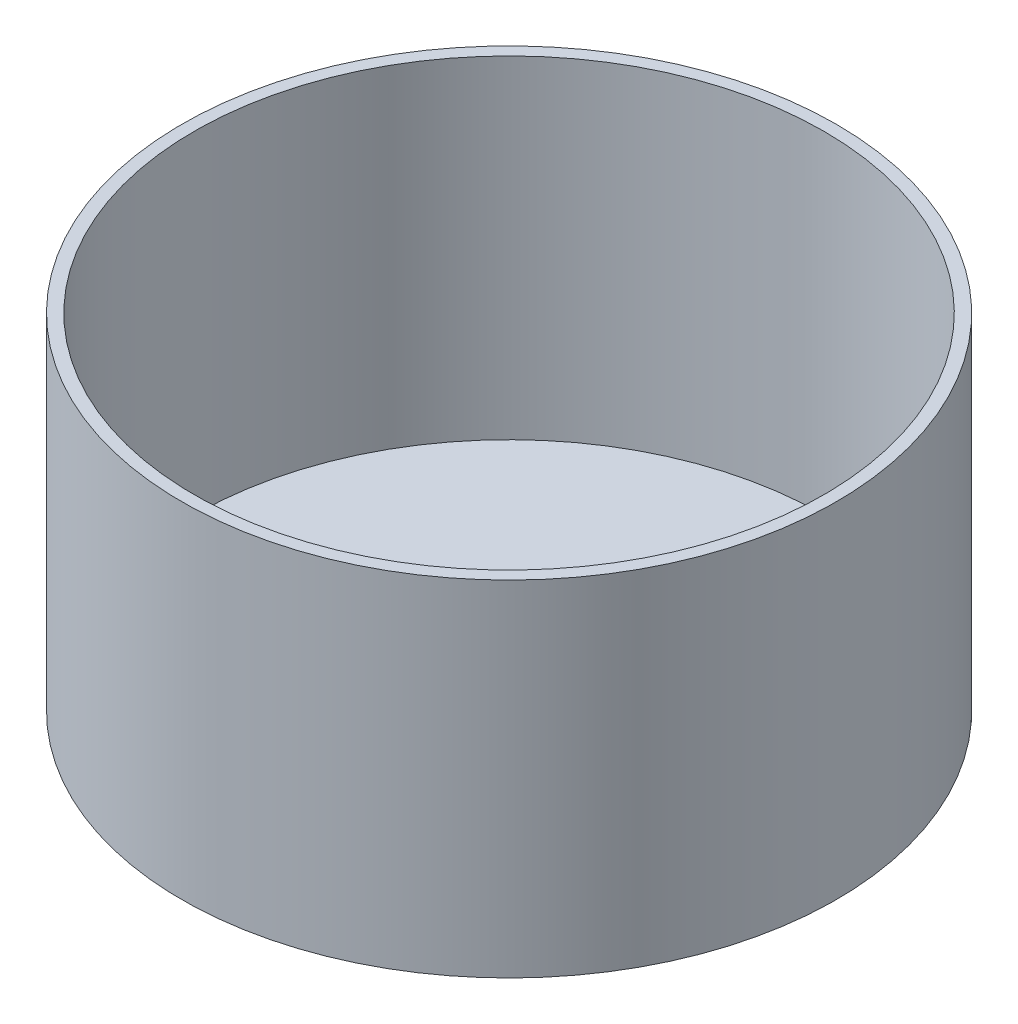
from build123d import *


with BuildPart() as part:
    # Skizze1 → Rotation-D_nn1 (revolve)
    with BuildSketch(Plane.XY, mode=Mode.PRIVATE) as rotation_d_nn1_sk:
        Polygon((-800, 842.790940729), (-800, 0), (0, 0), (0, 30), (-770, 30), (-770, 842.790940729), align=None)
    revolve(rotation_d_nn1_sk.sketch.rotate(Axis((0, 0, 0), (0, 1, 0)), 270), axis=Axis((0, 0, 0), (0, 1, 0)))


solid = part.part
